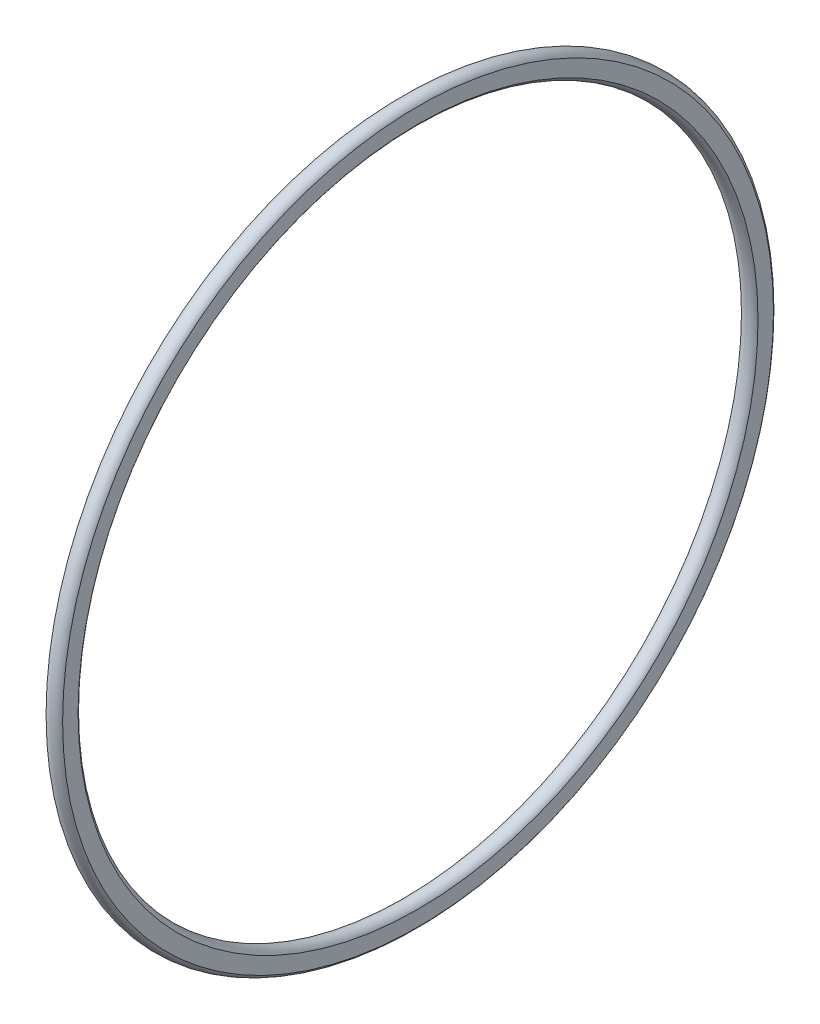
from build123d import *


with BuildPart() as part:
    # Sketch1 → Revolve1 (revolve)
    with BuildSketch(Plane.XY, mode=Mode.PRIVATE) as revolve1_sk:
        with BuildLine():
            Line((0, 41.809671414), (0, 43.712128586))
            ThreePointArc((0, 43.712128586), (-0.9906, 44.2849), (-1.9812, 43.712128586))
            Line((-1.9812, 43.712128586), (-1.9812, 41.809671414))
            ThreePointArc((-1.9812, 41.809671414), (-0.9906, 41.2369), (0, 41.809671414))
        make_face()
    revolve(revolve1_sk.sketch.rotate(Axis((0, 0, 0), (-1, 0, 0)), 90), axis=Axis((0, 0, 0), (-1, 0, 0)))


solid = part.part
